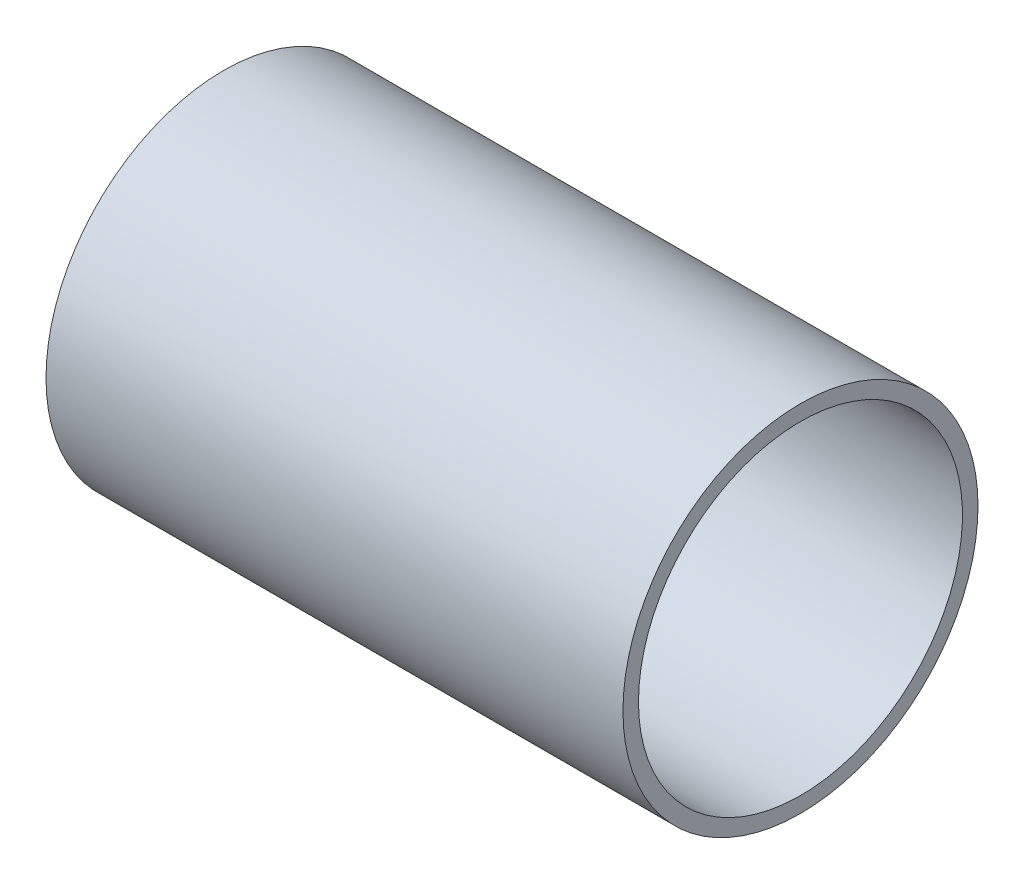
from build123d import *

# Parameters (mm, degrees)
ESQUISSE1_W = 13
ESQUISSE1_H = 0.35


with BuildPart() as part:
    # Esquisse1 → Base-R_volution (revolve)
    with BuildSketch(Plane.XY, mode=Mode.PRIVATE) as base_r_volution_sk:
        with Locations((-6.5, -0.175)):
            Rectangle(ESQUISSE1_W, ESQUISSE1_H)
    revolve(base_r_volution_sk.sketch.rotate(Axis((-22, 3.65, 0), (1, 0, 0)), 270), axis=Axis((-22, 3.65, 0), (1, 0, 0)))


solid = part.part
